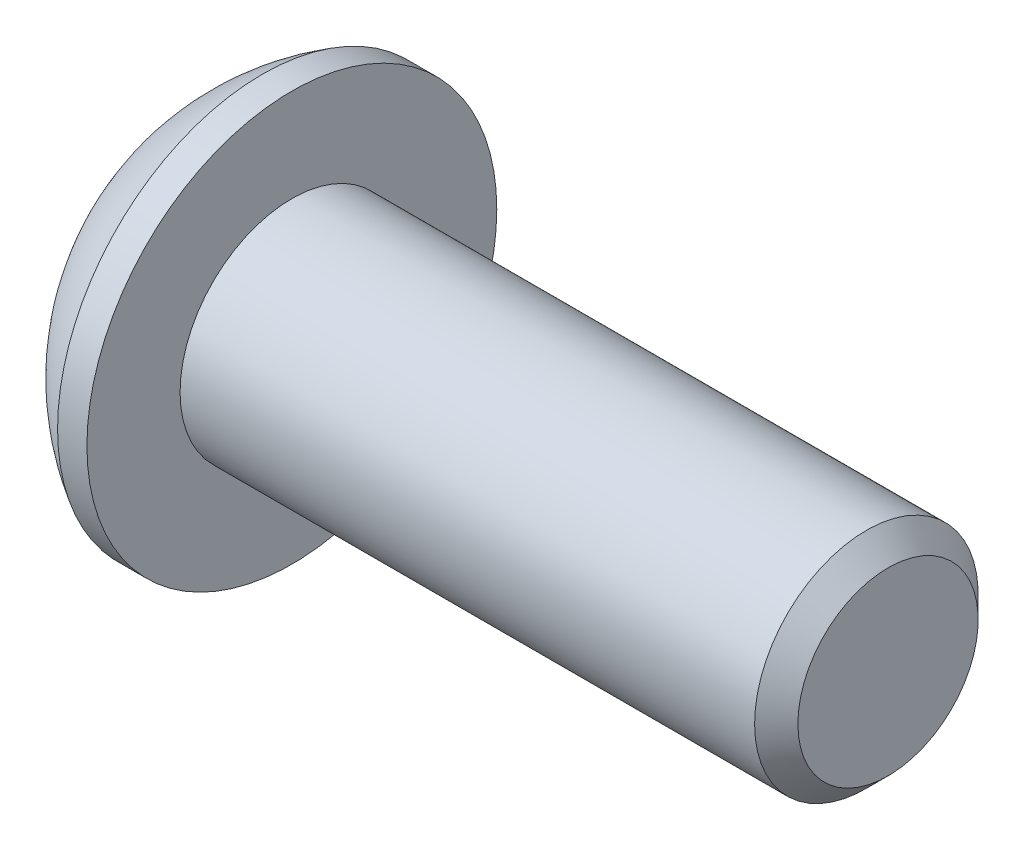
from build123d import *

# Parameters (mm, degrees)
HEX_2_DEPTH = 2.2098


with BuildPart() as part:
    # BodySke → BaseBody (revolve)
    with BuildSketch(Plane.XY, mode=Mode.PRIVATE) as basebody_sk:
        with BuildLine():
            Line((19.3528, 0), (19.3528, 2.41935))
            Line((19.3528, 2.41935), (18.77215, 3))
            Line((18.77215, 3), (3.3528, 3))
            Line((3.3528, 3), (3.3528, 5.5))
            Line((3.3528, 5.5), (2.5654, 5.5))
            ThreePointArc((2.5654, 5.5), (1.073848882, 4.319831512), (0, 2.75))
            Line((0, 2.75), (0, 0))
            Line((0, 0), (19.3528, 0))
        make_face()
    revolve(basebody_sk.sketch.rotate(Axis((0, 0, 0), (1, 0, 0)), 90), axis=Axis((0, 0, 0), (1, 0, 0)))

    # Sketch2 → PreBroach (revolve, cut)
    with BuildSketch(Plane.XY, mode=Mode.PRIVATE) as prebroach_sk:
        Polygon((0, 1.9812), (2.2098, 1.9812), (3.353646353, 0), (0, 0), align=None)
    revolve(prebroach_sk.sketch.rotate(Axis((0, 0, 0), (1, 0, 0)), 90), axis=Axis((0, 0, 0), (1, 0, 0)), mode=Mode.SUBTRACT)

    # Sketch3 → Hex 2 (cut)
    with BuildSketch(Plane(origin=(0, 0, 0), x_dir=(0, 0, -1), z_dir=(1, 0, 0))):
        Polygon((-2, -1.154700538), (-2, 1.154700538), (0, 2.309401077), (2, 1.154700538), (2, -1.154700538), (0, -2.309401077), align=None)
    extrude(amount=HEX_2_DEPTH, mode=Mode.SUBTRACT)


solid = part.part
